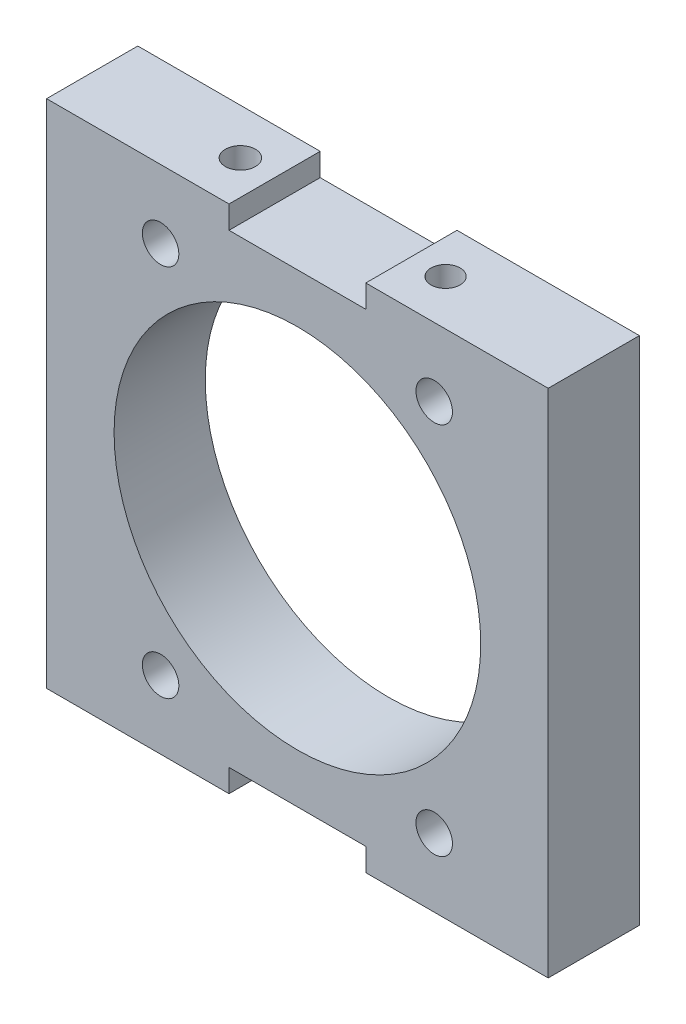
ISO-10303-21;
HEADER;
FILE_DESCRIPTION(('STEP AP214'),'2;1');
FILE_NAME('part.step','',(''),(''),'','','');
FILE_SCHEMA(('AUTOMOTIVE_DESIGN { 1 0 10303 214 1 1 1 1 }'));
ENDSEC;
DATA;
#1=APPLICATION_CONTEXT('core data for automotive mechanical design processes');
#2=APPLICATION_PROTOCOL_DEFINITION('international standard','automotive_design',2000,#1);
#3=PRODUCT_CONTEXT('',#1,'mechanical');
#4=PRODUCT('Part','Part','',(#3));
#5=PRODUCT_RELATED_PRODUCT_CATEGORY('part','',(#4));
#6=PRODUCT_DEFINITION_FORMATION('','',#4);
#7=PRODUCT_DEFINITION_CONTEXT('part definition',#1,'design');
#8=PRODUCT_DEFINITION('design','',#6,#7);
#9=PRODUCT_DEFINITION_SHAPE('','',#8);
#10=(LENGTH_UNIT() NAMED_UNIT(*) SI_UNIT(.MILLI.,.METRE.));
#11=(NAMED_UNIT(*) PLANE_ANGLE_UNIT() SI_UNIT($,.RADIAN.));
#12=(NAMED_UNIT(*) SI_UNIT($,.STERADIAN.) SOLID_ANGLE_UNIT());
#13=UNCERTAINTY_MEASURE_WITH_UNIT(LENGTH_MEASURE(1.E-05),#10,'distance_accuracy_value','');
#14=(GEOMETRIC_REPRESENTATION_CONTEXT(3) GLOBAL_UNCERTAINTY_ASSIGNED_CONTEXT((#13)) GLOBAL_UNIT_ASSIGNED_CONTEXT((#10,
#11,#12)) REPRESENTATION_CONTEXT('',''));
#15=CARTESIAN_POINT('',(0.,0.,0.));
#16=DIRECTION('',(0.,0.,1.));
#17=DIRECTION('',(1.,0.,0.));
#18=AXIS2_PLACEMENT_3D('',#15,#16,#17);
#19=CARTESIAN_POINT('',(0.,0.,20.));
#20=DIRECTION('',(0.,0.,-1.));
#21=DIRECTION('',(-1.,0.,0.));
#22=AXIS2_PLACEMENT_3D('',#19,#20,#21);
#23=PLANE('',#22);
#24=CARTESIAN_POINT('',(30.,40.9999999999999,20.));
#25=DIRECTION('',(0.,0.,1.));
#26=DIRECTION('',(1.,0.,0.));
#27=AXIS2_PLACEMENT_3D('',#24,#25,#26);
#28=CIRCLE('',#27,4.);
#29=CARTESIAN_POINT('',(34.,40.9999999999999,20.));
#30=VERTEX_POINT('',#29);
#31=EDGE_CURVE('E278',#30,#30,#28,.T.);
#32=ORIENTED_EDGE('',*,*,#31,.F.);
#33=EDGE_LOOP('',(#32));
#34=FACE_BOUND('',#33,.T.);
#35=CARTESIAN_POINT('',(-30.,40.9999999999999,20.));
#36=DIRECTION('',(0.,0.,1.));
#37=DIRECTION('',(1.,0.,0.));
#38=AXIS2_PLACEMENT_3D('',#35,#36,#37);
#39=CIRCLE('',#38,4.00000000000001);
#40=CARTESIAN_POINT('',(-26.,40.9999999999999,20.));
#41=VERTEX_POINT('',#40);
#42=EDGE_CURVE('E266',#41,#41,#39,.T.);
#43=ORIENTED_EDGE('',*,*,#42,.F.);
#44=EDGE_LOOP('',(#43));
#45=FACE_BOUND('',#44,.T.);
#46=DIRECTION('',(-1.,0.,0.));
#47=VECTOR('',#46,1.);
#48=CARTESIAN_POINT('',(-55.,55.9999999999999,20.));
#49=LINE('',#48,#47);
#50=CARTESIAN_POINT('',(-15.0000000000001,55.9999999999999,20.));
#51=VERTEX_POINT('',#50);
#52=CARTESIAN_POINT('',(-55.,55.9999999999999,20.));
#53=VERTEX_POINT('',#52);
#54=EDGE_CURVE('E193',#51,#53,#49,.T.);
#55=ORIENTED_EDGE('',*,*,#54,.T.);
#56=DIRECTION('',(0.,-1.,0.));
#57=VECTOR('',#56,1.);
#58=CARTESIAN_POINT('',(-55.,55.9999999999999,20.));
#59=LINE('',#58,#57);
#60=CARTESIAN_POINT('',(-55.,-55.9999999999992,20.));
#61=VERTEX_POINT('',#60);
#62=EDGE_CURVE('E114',#53,#61,#59,.T.);
#63=ORIENTED_EDGE('',*,*,#62,.T.);
#64=DIRECTION('',(1.,0.,0.));
#65=VECTOR('',#64,1.);
#66=CARTESIAN_POINT('',(-15.,-55.9999999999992,20.));
#67=LINE('',#66,#65);
#68=CARTESIAN_POINT('',(-15.,-55.9999999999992,20.));
#69=VERTEX_POINT('',#68);
#70=EDGE_CURVE('E239',#61,#69,#67,.T.);
#71=ORIENTED_EDGE('',*,*,#70,.T.);
#72=DIRECTION('',(0.,1.,0.));
#73=VECTOR('',#72,1.);
#74=CARTESIAN_POINT('',(-15.,-55.9999999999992,20.));
#75=LINE('',#74,#73);
#76=CARTESIAN_POINT('',(-15.,-50.9999999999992,20.));
#77=VERTEX_POINT('',#76);
#78=EDGE_CURVE('E236',#69,#77,#75,.T.);
#79=ORIENTED_EDGE('',*,*,#78,.T.);
#80=DIRECTION('',(1.,0.,0.));
#81=VECTOR('',#80,1.);
#82=CARTESIAN_POINT('',(15.0000000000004,-50.9999999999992,20.));
#83=LINE('',#82,#81);
#84=CARTESIAN_POINT('',(15.0000000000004,-50.9999999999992,20.));
#85=VERTEX_POINT('',#84);
#86=EDGE_CURVE('E238',#77,#85,#83,.T.);
#87=ORIENTED_EDGE('',*,*,#86,.T.);
#88=DIRECTION('',(0.,-1.,0.));
#89=VECTOR('',#88,1.);
#90=CARTESIAN_POINT('',(15.0000000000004,-56.0000000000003,20.));
#91=LINE('',#90,#89);
#92=CARTESIAN_POINT('',(15.0000000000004,-56.0000000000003,20.));
#93=VERTEX_POINT('',#92);
#94=EDGE_CURVE('E241',#85,#93,#91,.T.);
#95=ORIENTED_EDGE('',*,*,#94,.T.);
#96=DIRECTION('',(1.,0.,0.));
#97=VECTOR('',#96,1.);
#98=CARTESIAN_POINT('',(15.0000000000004,-56.0000000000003,20.));
#99=LINE('',#98,#97);
#100=CARTESIAN_POINT('',(55.,-56.0000000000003,20.));
#101=VERTEX_POINT('',#100);
#102=EDGE_CURVE('E247',#93,#101,#99,.T.);
#103=ORIENTED_EDGE('',*,*,#102,.T.);
#104=DIRECTION('',(0.,1.,0.));
#105=VECTOR('',#104,1.);
#106=CARTESIAN_POINT('',(55.,56.0000000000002,20.));
#107=LINE('',#106,#105);
#108=CARTESIAN_POINT('',(55.,56.0000000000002,20.));
#109=VERTEX_POINT('',#108);
#110=EDGE_CURVE('E249',#101,#109,#107,.T.);
#111=ORIENTED_EDGE('',*,*,#110,.T.);
#112=DIRECTION('',(-1.,0.,0.));
#113=VECTOR('',#112,1.);
#114=CARTESIAN_POINT('',(15.0000000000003,56.0000000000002,20.));
#115=LINE('',#114,#113);
#116=CARTESIAN_POINT('',(15.0000000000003,56.0000000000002,20.));
#117=VERTEX_POINT('',#116);
#118=EDGE_CURVE('E148',#109,#117,#115,.T.);
#119=ORIENTED_EDGE('',*,*,#118,.T.);
#120=DIRECTION('',(0.,-1.,0.));
#121=VECTOR('',#120,1.);
#122=CARTESIAN_POINT('',(15.0000000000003,50.9999999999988,20.));
#123=LINE('',#122,#121);
#124=CARTESIAN_POINT('',(15.0000000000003,50.9999999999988,20.));
#125=VERTEX_POINT('',#124);
#126=EDGE_CURVE('E141',#117,#125,#123,.T.);
#127=ORIENTED_EDGE('',*,*,#126,.T.);
#128=DIRECTION('',(-1.,0.,0.));
#129=VECTOR('',#128,1.);
#130=CARTESIAN_POINT('',(-15.,50.9999999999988,20.));
#131=LINE('',#130,#129);
#132=CARTESIAN_POINT('',(-15.,50.9999999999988,20.));
#133=VERTEX_POINT('',#132);
#134=EDGE_CURVE('E145',#125,#133,#131,.T.);
#135=ORIENTED_EDGE('',*,*,#134,.T.);
#136=DIRECTION('',(0.,1.,0.));
#137=VECTOR('',#136,1.);
#138=CARTESIAN_POINT('',(-15.0000000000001,55.9999999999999,20.));
#139=LINE('',#138,#137);
#140=EDGE_CURVE('E60',#133,#51,#139,.T.);
#141=ORIENTED_EDGE('',*,*,#140,.T.);
#142=EDGE_LOOP('',(#55,#63,#71,#79,#87,#95,#103,#111,#119,#127,#135,#141));
#143=FACE_BOUND('',#142,.T.);
#144=CARTESIAN_POINT('',(0.,0.,20.));
#145=DIRECTION('',(0.,0.,1.));
#146=DIRECTION('',(1.,0.,0.));
#147=AXIS2_PLACEMENT_3D('',#144,#145,#146);
#148=CIRCLE('',#147,40.2);
#149=CARTESIAN_POINT('',(40.2,0.,20.));
#150=VERTEX_POINT('',#149);
#151=EDGE_CURVE('E173',#150,#150,#148,.T.);
#152=ORIENTED_EDGE('',*,*,#151,.F.);
#153=EDGE_LOOP('',(#152));
#154=FACE_BOUND('',#153,.T.);
#155=CARTESIAN_POINT('',(-30.,-40.9999999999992,20.));
#156=DIRECTION('',(0.,0.,1.));
#157=DIRECTION('',(1.,0.,0.));
#158=AXIS2_PLACEMENT_3D('',#155,#156,#157);
#159=CIRCLE('',#158,4.00000000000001);
#160=CARTESIAN_POINT('',(-26.,-40.9999999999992,20.));
#161=VERTEX_POINT('',#160);
#162=EDGE_CURVE('E272',#161,#161,#159,.T.);
#163=ORIENTED_EDGE('',*,*,#162,.F.);
#164=EDGE_LOOP('',(#163));
#165=FACE_BOUND('',#164,.T.);
#166=CARTESIAN_POINT('',(30.,-40.9999999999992,20.));
#167=DIRECTION('',(0.,0.,1.));
#168=DIRECTION('',(1.,0.,0.));
#169=AXIS2_PLACEMENT_3D('',#166,#167,#168);
#170=CIRCLE('',#169,4.);
#171=CARTESIAN_POINT('',(34.,-40.9999999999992,20.));
#172=VERTEX_POINT('',#171);
#173=EDGE_CURVE('E284',#172,#172,#170,.T.);
#174=ORIENTED_EDGE('',*,*,#173,.F.);
#175=EDGE_LOOP('',(#174));
#176=FACE_BOUND('',#175,.T.);
#177=ADVANCED_FACE('F32',(#34,#45,#143,#154,#165,#176),#23,.F.);
#178=CARTESIAN_POINT('',(0.,0.,0.));
#179=DIRECTION('',(0.,0.,-1.));
#180=DIRECTION('',(-1.,0.,0.));
#181=AXIS2_PLACEMENT_3D('',#178,#179,#180);
#182=PLANE('',#181);
#183=CARTESIAN_POINT('',(30.,40.9999999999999,0.));
#184=DIRECTION('',(0.,0.,1.));
#185=DIRECTION('',(1.,0.,0.));
#186=AXIS2_PLACEMENT_3D('',#183,#184,#185);
#187=CIRCLE('',#186,4.);
#188=CARTESIAN_POINT('',(34.,40.9999999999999,0.));
#189=VERTEX_POINT('',#188);
#190=EDGE_CURVE('E281',#189,#189,#187,.T.);
#191=ORIENTED_EDGE('',*,*,#190,.T.);
#192=EDGE_LOOP('',(#191));
#193=FACE_BOUND('',#192,.T.);
#194=CARTESIAN_POINT('',(-30.,40.9999999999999,0.));
#195=DIRECTION('',(0.,0.,1.));
#196=DIRECTION('',(1.,0.,0.));
#197=AXIS2_PLACEMENT_3D('',#194,#195,#196);
#198=CIRCLE('',#197,4.00000000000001);
#199=CARTESIAN_POINT('',(-26.,40.9999999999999,0.));
#200=VERTEX_POINT('',#199);
#201=EDGE_CURVE('E269',#200,#200,#198,.T.);
#202=ORIENTED_EDGE('',*,*,#201,.T.);
#203=EDGE_LOOP('',(#202));
#204=FACE_BOUND('',#203,.T.);
#205=DIRECTION('',(-1.,0.,0.));
#206=VECTOR('',#205,1.);
#207=CARTESIAN_POINT('',(-55.,55.9999999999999,0.));
#208=LINE('',#207,#206);
#209=CARTESIAN_POINT('',(-15.0000000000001,55.9999999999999,0.));
#210=VERTEX_POINT('',#209);
#211=CARTESIAN_POINT('',(-55.,55.9999999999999,0.));
#212=VERTEX_POINT('',#211);
#213=EDGE_CURVE('E169',#210,#212,#208,.T.);
#214=ORIENTED_EDGE('',*,*,#213,.F.);
#215=DIRECTION('',(0.,1.,0.));
#216=VECTOR('',#215,1.);
#217=CARTESIAN_POINT('',(-15.0000000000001,55.9999999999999,0.));
#218=LINE('',#217,#216);
#219=CARTESIAN_POINT('',(-15.,50.9999999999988,0.));
#220=VERTEX_POINT('',#219);
#221=EDGE_CURVE('E105',#220,#210,#218,.T.);
#222=ORIENTED_EDGE('',*,*,#221,.F.);
#223=DIRECTION('',(-1.,0.,0.));
#224=VECTOR('',#223,1.);
#225=CARTESIAN_POINT('',(-15.,50.9999999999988,0.));
#226=LINE('',#225,#224);
#227=CARTESIAN_POINT('',(15.0000000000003,50.9999999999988,0.));
#228=VERTEX_POINT('',#227);
#229=EDGE_CURVE('E190',#228,#220,#226,.T.);
#230=ORIENTED_EDGE('',*,*,#229,.F.);
#231=DIRECTION('',(0.,-1.,0.));
#232=VECTOR('',#231,1.);
#233=CARTESIAN_POINT('',(15.0000000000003,50.9999999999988,0.));
#234=LINE('',#233,#232);
#235=CARTESIAN_POINT('',(15.0000000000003,56.0000000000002,0.));
#236=VERTEX_POINT('',#235);
#237=EDGE_CURVE('E157',#236,#228,#234,.T.);
#238=ORIENTED_EDGE('',*,*,#237,.F.);
#239=DIRECTION('',(-1.,0.,0.));
#240=VECTOR('',#239,1.);
#241=CARTESIAN_POINT('',(15.0000000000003,56.0000000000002,0.));
#242=LINE('',#241,#240);
#243=CARTESIAN_POINT('',(55.,56.0000000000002,0.));
#244=VERTEX_POINT('',#243);
#245=EDGE_CURVE('E187',#244,#236,#242,.T.);
#246=ORIENTED_EDGE('',*,*,#245,.F.);
#247=DIRECTION('',(0.,1.,0.));
#248=VECTOR('',#247,1.);
#249=CARTESIAN_POINT('',(55.,56.0000000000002,0.));
#250=LINE('',#249,#248);
#251=CARTESIAN_POINT('',(55.,-56.0000000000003,0.));
#252=VERTEX_POINT('',#251);
#253=EDGE_CURVE('E185',#252,#244,#250,.T.);
#254=ORIENTED_EDGE('',*,*,#253,.F.);
#255=DIRECTION('',(1.,0.,0.));
#256=VECTOR('',#255,1.);
#257=CARTESIAN_POINT('',(15.0000000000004,-56.0000000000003,0.));
#258=LINE('',#257,#256);
#259=CARTESIAN_POINT('',(15.0000000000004,-56.0000000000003,0.));
#260=VERTEX_POINT('',#259);
#261=EDGE_CURVE('E183',#260,#252,#258,.T.);
#262=ORIENTED_EDGE('',*,*,#261,.F.);
#263=DIRECTION('',(0.,-1.,0.));
#264=VECTOR('',#263,1.);
#265=CARTESIAN_POINT('',(15.0000000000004,-56.0000000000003,0.));
#266=LINE('',#265,#264);
#267=CARTESIAN_POINT('',(15.0000000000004,-50.9999999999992,0.));
#268=VERTEX_POINT('',#267);
#269=EDGE_CURVE('E181',#268,#260,#266,.T.);
#270=ORIENTED_EDGE('',*,*,#269,.F.);
#271=DIRECTION('',(1.,0.,0.));
#272=VECTOR('',#271,1.);
#273=CARTESIAN_POINT('',(15.0000000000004,-50.9999999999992,0.));
#274=LINE('',#273,#272);
#275=CARTESIAN_POINT('',(-15.,-50.9999999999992,0.));
#276=VERTEX_POINT('',#275);
#277=EDGE_CURVE('E179',#276,#268,#274,.T.);
#278=ORIENTED_EDGE('',*,*,#277,.F.);
#279=DIRECTION('',(0.,1.,0.));
#280=VECTOR('',#279,1.);
#281=CARTESIAN_POINT('',(-15.,-55.9999999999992,0.));
#282=LINE('',#281,#280);
#283=CARTESIAN_POINT('',(-15.,-55.9999999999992,0.));
#284=VERTEX_POINT('',#283);
#285=EDGE_CURVE('E177',#284,#276,#282,.T.);
#286=ORIENTED_EDGE('',*,*,#285,.F.);
#287=DIRECTION('',(1.,0.,0.));
#288=VECTOR('',#287,1.);
#289=CARTESIAN_POINT('',(-15.,-55.9999999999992,0.));
#290=LINE('',#289,#288);
#291=CARTESIAN_POINT('',(-55.,-55.9999999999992,0.));
#292=VERTEX_POINT('',#291);
#293=EDGE_CURVE('E175',#292,#284,#290,.T.);
#294=ORIENTED_EDGE('',*,*,#293,.F.);
#295=DIRECTION('',(0.,-1.,0.));
#296=VECTOR('',#295,1.);
#297=CARTESIAN_POINT('',(-55.,55.9999999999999,0.));
#298=LINE('',#297,#296);
#299=EDGE_CURVE('E172',#212,#292,#298,.T.);
#300=ORIENTED_EDGE('',*,*,#299,.F.);
#301=EDGE_LOOP('',(#214,#222,#230,#238,#246,#254,#262,#270,#278,#286,#294,#300));
#302=FACE_BOUND('',#301,.T.);
#303=CARTESIAN_POINT('',(0.,0.,0.));
#304=DIRECTION('',(0.,0.,1.));
#305=DIRECTION('',(1.,0.,0.));
#306=AXIS2_PLACEMENT_3D('',#303,#304,#305);
#307=CIRCLE('',#306,40.2);
#308=CARTESIAN_POINT('',(40.2,0.,0.));
#309=VERTEX_POINT('',#308);
#310=EDGE_CURVE('E263',#309,#309,#307,.T.);
#311=ORIENTED_EDGE('',*,*,#310,.T.);
#312=EDGE_LOOP('',(#311));
#313=FACE_BOUND('',#312,.T.);
#314=CARTESIAN_POINT('',(-30.,-40.9999999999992,0.));
#315=DIRECTION('',(0.,0.,1.));
#316=DIRECTION('',(1.,0.,0.));
#317=AXIS2_PLACEMENT_3D('',#314,#315,#316);
#318=CIRCLE('',#317,4.00000000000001);
#319=CARTESIAN_POINT('',(-26.,-40.9999999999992,0.));
#320=VERTEX_POINT('',#319);
#321=EDGE_CURVE('E275',#320,#320,#318,.T.);
#322=ORIENTED_EDGE('',*,*,#321,.T.);
#323=EDGE_LOOP('',(#322));
#324=FACE_BOUND('',#323,.T.);
#325=CARTESIAN_POINT('',(30.,-40.9999999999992,0.));
#326=DIRECTION('',(0.,0.,1.));
#327=DIRECTION('',(1.,0.,0.));
#328=AXIS2_PLACEMENT_3D('',#325,#326,#327);
#329=CIRCLE('',#328,4.);
#330=CARTESIAN_POINT('',(34.,-40.9999999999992,0.));
#331=VERTEX_POINT('',#330);
#332=EDGE_CURVE('E287',#331,#331,#329,.T.);
#333=ORIENTED_EDGE('',*,*,#332,.T.);
#334=EDGE_LOOP('',(#333));
#335=FACE_BOUND('',#334,.T.);
#336=ADVANCED_FACE('F223',(#193,#204,#302,#313,#324,#335),#182,.T.);
#337=CARTESIAN_POINT('',(-55.,55.9999999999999,20.));
#338=DIRECTION('',(0.,-1.,0.));
#339=DIRECTION('',(1.,0.,0.));
#340=AXIS2_PLACEMENT_3D('',#337,#338,#339);
#341=PLANE('',#340);
#342=CARTESIAN_POINT('',(-22.5000000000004,55.9999999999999,10.));
#343=DIRECTION('',(0.,1.,0.));
#344=DIRECTION('',(0.,0.,1.));
#345=AXIS2_PLACEMENT_3D('',#342,#343,#344);
#346=CIRCLE('',#345,3.29999999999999);
#347=CARTESIAN_POINT('',(-22.5000000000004,55.9999999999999,13.3));
#348=VERTEX_POINT('',#347);
#349=EDGE_CURVE('E323',#348,#348,#346,.T.);
#350=ORIENTED_EDGE('',*,*,#349,.F.);
#351=EDGE_LOOP('',(#350));
#352=FACE_BOUND('',#351,.T.);
#353=ORIENTED_EDGE('',*,*,#213,.T.);
#354=DIRECTION('',(0.,0.,-1.));
#355=VECTOR('',#354,1.);
#356=CARTESIAN_POINT('',(-55.,55.9999999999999,20.));
#357=LINE('',#356,#355);
#358=EDGE_CURVE('E45',#53,#212,#357,.T.);
#359=ORIENTED_EDGE('',*,*,#358,.F.);
#360=ORIENTED_EDGE('',*,*,#54,.F.);
#361=DIRECTION('',(0.,0.,-1.));
#362=VECTOR('',#361,1.);
#363=CARTESIAN_POINT('',(-15.0000000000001,55.9999999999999,20.));
#364=LINE('',#363,#362);
#365=EDGE_CURVE('E165',#51,#210,#364,.T.);
#366=ORIENTED_EDGE('',*,*,#365,.T.);
#367=EDGE_LOOP('',(#353,#359,#360,#366));
#368=FACE_BOUND('',#367,.T.);
#369=ADVANCED_FACE('F34',(#352,#368),#341,.F.);
#370=CARTESIAN_POINT('',(-55.,55.9999999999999,20.));
#371=DIRECTION('',(1.,0.,0.));
#372=DIRECTION('',(0.,1.,0.));
#373=AXIS2_PLACEMENT_3D('',#370,#371,#372);
#374=PLANE('',#373);
#375=ORIENTED_EDGE('',*,*,#299,.T.);
#376=DIRECTION('',(0.,0.,-1.));
#377=VECTOR('',#376,1.);
#378=CARTESIAN_POINT('',(-55.,-55.9999999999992,20.));
#379=LINE('',#378,#377);
#380=EDGE_CURVE('E215',#61,#292,#379,.T.);
#381=ORIENTED_EDGE('',*,*,#380,.F.);
#382=ORIENTED_EDGE('',*,*,#62,.F.);
#383=ORIENTED_EDGE('',*,*,#358,.T.);
#384=EDGE_LOOP('',(#375,#381,#382,#383));
#385=FACE_BOUND('',#384,.T.);
#386=ADVANCED_FACE('F218',(#385),#374,.F.);
#387=CARTESIAN_POINT('',(-15.,-55.9999999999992,20.));
#388=DIRECTION('',(0.,1.,0.));
#389=DIRECTION('',(0.,0.,1.));
#390=AXIS2_PLACEMENT_3D('',#387,#388,#389);
#391=PLANE('',#390);
#392=CARTESIAN_POINT('',(-22.5000000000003,-55.9999999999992,10.));
#393=DIRECTION('',(0.,-1.,0.));
#394=DIRECTION('',(0.,0.,-1.));
#395=AXIS2_PLACEMENT_3D('',#392,#393,#394);
#396=CIRCLE('',#395,3.19999999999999);
#397=CARTESIAN_POINT('',(-22.5000000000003,-55.9999999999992,6.80000000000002));
#398=VERTEX_POINT('',#397);
#399=EDGE_CURVE('E311',#398,#398,#396,.T.);
#400=ORIENTED_EDGE('',*,*,#399,.F.);
#401=EDGE_LOOP('',(#400));
#402=FACE_BOUND('',#401,.T.);
#403=ORIENTED_EDGE('',*,*,#293,.T.);
#404=DIRECTION('',(0.,0.,-1.));
#405=VECTOR('',#404,1.);
#406=CARTESIAN_POINT('',(-15.,-55.9999999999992,20.));
#407=LINE('',#406,#405);
#408=EDGE_CURVE('E212',#69,#284,#407,.T.);
#409=ORIENTED_EDGE('',*,*,#408,.F.);
#410=ORIENTED_EDGE('',*,*,#70,.F.);
#411=ORIENTED_EDGE('',*,*,#380,.T.);
#412=EDGE_LOOP('',(#403,#409,#410,#411));
#413=FACE_BOUND('',#412,.T.);
#414=ADVANCED_FACE('F230',(#402,#413),#391,.F.);
#415=CARTESIAN_POINT('',(-15.,-55.9999999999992,20.));
#416=DIRECTION('',(-1.,0.,0.));
#417=DIRECTION('',(0.,0.,1.));
#418=AXIS2_PLACEMENT_3D('',#415,#416,#417);
#419=PLANE('',#418);
#420=ORIENTED_EDGE('',*,*,#285,.T.);
#421=DIRECTION('',(0.,0.,-1.));
#422=VECTOR('',#421,1.);
#423=CARTESIAN_POINT('',(-15.,-50.9999999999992,20.));
#424=LINE('',#423,#422);
#425=EDGE_CURVE('E209',#77,#276,#424,.T.);
#426=ORIENTED_EDGE('',*,*,#425,.F.);
#427=ORIENTED_EDGE('',*,*,#78,.F.);
#428=ORIENTED_EDGE('',*,*,#408,.T.);
#429=EDGE_LOOP('',(#420,#426,#427,#428));
#430=FACE_BOUND('',#429,.T.);
#431=ADVANCED_FACE('F234',(#430),#419,.F.);
#432=CARTESIAN_POINT('',(15.0000000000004,-50.9999999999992,20.));
#433=DIRECTION('',(0.,1.,0.));
#434=DIRECTION('',(0.,0.,1.));
#435=AXIS2_PLACEMENT_3D('',#432,#433,#434);
#436=PLANE('',#435);
#437=ORIENTED_EDGE('',*,*,#277,.T.);
#438=DIRECTION('',(0.,0.,-1.));
#439=VECTOR('',#438,1.);
#440=CARTESIAN_POINT('',(15.0000000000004,-50.9999999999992,20.));
#441=LINE('',#440,#439);
#442=EDGE_CURVE('E206',#85,#268,#441,.T.);
#443=ORIENTED_EDGE('',*,*,#442,.F.);
#444=ORIENTED_EDGE('',*,*,#86,.F.);
#445=ORIENTED_EDGE('',*,*,#425,.T.);
#446=EDGE_LOOP('',(#437,#443,#444,#445));
#447=FACE_BOUND('',#446,.T.);
#448=ADVANCED_FACE('F365',(#447),#436,.F.);
#449=CARTESIAN_POINT('',(15.0000000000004,-56.0000000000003,20.));
#450=DIRECTION('',(1.,0.,0.));
#451=DIRECTION('',(0.,0.,-1.));
#452=AXIS2_PLACEMENT_3D('',#449,#450,#451);
#453=PLANE('',#452);
#454=ORIENTED_EDGE('',*,*,#269,.T.);
#455=DIRECTION('',(0.,0.,-1.));
#456=VECTOR('',#455,1.);
#457=CARTESIAN_POINT('',(15.0000000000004,-56.0000000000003,20.));
#458=LINE('',#457,#456);
#459=EDGE_CURVE('E203',#93,#260,#458,.T.);
#460=ORIENTED_EDGE('',*,*,#459,.F.);
#461=ORIENTED_EDGE('',*,*,#94,.F.);
#462=ORIENTED_EDGE('',*,*,#442,.T.);
#463=EDGE_LOOP('',(#454,#460,#461,#462));
#464=FACE_BOUND('',#463,.T.);
#465=ADVANCED_FACE('F361',(#464),#453,.F.);
#466=CARTESIAN_POINT('',(15.0000000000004,-56.0000000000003,20.));
#467=DIRECTION('',(0.,1.,0.));
#468=DIRECTION('',(0.,0.,1.));
#469=AXIS2_PLACEMENT_3D('',#466,#467,#468);
#470=PLANE('',#469);
#471=CARTESIAN_POINT('',(22.4999999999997,-55.9999999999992,10.0000000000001));
#472=DIRECTION('',(0.,-1.,0.));
#473=DIRECTION('',(0.,0.,-1.));
#474=AXIS2_PLACEMENT_3D('',#471,#472,#473);
#475=CIRCLE('',#474,3.19999999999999);
#476=CARTESIAN_POINT('',(22.4999999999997,-55.9999999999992,6.80000000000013));
#477=VERTEX_POINT('',#476);
#478=EDGE_CURVE('E317',#477,#477,#475,.T.);
#479=ORIENTED_EDGE('',*,*,#478,.F.);
#480=EDGE_LOOP('',(#479));
#481=FACE_BOUND('',#480,.T.);
#482=ORIENTED_EDGE('',*,*,#261,.T.);
#483=DIRECTION('',(0.,0.,-1.));
#484=VECTOR('',#483,1.);
#485=CARTESIAN_POINT('',(55.,-56.0000000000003,20.));
#486=LINE('',#485,#484);
#487=EDGE_CURVE('E200',#101,#252,#486,.T.);
#488=ORIENTED_EDGE('',*,*,#487,.F.);
#489=ORIENTED_EDGE('',*,*,#102,.F.);
#490=ORIENTED_EDGE('',*,*,#459,.T.);
#491=EDGE_LOOP('',(#482,#488,#489,#490));
#492=FACE_BOUND('',#491,.T.);
#493=ADVANCED_FACE('F358',(#481,#492),#470,.F.);
#494=CARTESIAN_POINT('',(55.,56.0000000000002,20.));
#495=DIRECTION('',(-1.,0.,0.));
#496=DIRECTION('',(0.,0.,1.));
#497=AXIS2_PLACEMENT_3D('',#494,#495,#496);
#498=PLANE('',#497);
#499=ORIENTED_EDGE('',*,*,#253,.T.);
#500=DIRECTION('',(0.,0.,-1.));
#501=VECTOR('',#500,1.);
#502=CARTESIAN_POINT('',(55.,56.0000000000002,20.));
#503=LINE('',#502,#501);
#504=EDGE_CURVE('E197',#109,#244,#503,.T.);
#505=ORIENTED_EDGE('',*,*,#504,.F.);
#506=ORIENTED_EDGE('',*,*,#110,.F.);
#507=ORIENTED_EDGE('',*,*,#487,.T.);
#508=EDGE_LOOP('',(#499,#505,#506,#507));
#509=FACE_BOUND('',#508,.T.);
#510=ADVANCED_FACE('F255',(#509),#498,.F.);
#511=CARTESIAN_POINT('',(15.0000000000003,56.0000000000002,20.));
#512=DIRECTION('',(0.,-1.,0.));
#513=DIRECTION('',(1.,0.,0.));
#514=AXIS2_PLACEMENT_3D('',#511,#512,#513);
#515=PLANE('',#514);
#516=CARTESIAN_POINT('',(22.4999999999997,56.0000000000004,10.0000000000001));
#517=DIRECTION('',(0.,1.,0.));
#518=DIRECTION('',(0.,0.,1.));
#519=AXIS2_PLACEMENT_3D('',#516,#517,#518);
#520=CIRCLE('',#519,3.19999999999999);
#521=CARTESIAN_POINT('',(25.2029138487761,56.0000000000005,8.28703277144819));
#522=VERTEX_POINT('',#521);
#523=CARTESIAN_POINT('',(19.8191997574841,56.0000000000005,11.7473723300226));
#524=VERTEX_POINT('',#523);
#525=EDGE_CURVE('E295',#522,#524,#520,.T.);
#526=ORIENTED_EDGE('',*,*,#525,.F.);
#527=CARTESIAN_POINT('',(22.5221136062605,56.0000000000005,10.0344051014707));
#528=DIRECTION('',(0.,1.,0.));
#529=DIRECTION('',(0.,0.,1.));
#530=AXIS2_PLACEMENT_3D('',#527,#528,#529);
#531=CIRCLE('',#530,3.19999999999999);
#532=EDGE_CURVE('E305',#524,#522,#531,.T.);
#533=ORIENTED_EDGE('',*,*,#532,.F.);
#534=EDGE_LOOP('',(#526,#533));
#535=FACE_BOUND('',#534,.T.);
#536=ORIENTED_EDGE('',*,*,#245,.T.);
#537=DIRECTION('',(0.,0.,-1.));
#538=VECTOR('',#537,1.);
#539=CARTESIAN_POINT('',(15.0000000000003,56.0000000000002,20.));
#540=LINE('',#539,#538);
#541=EDGE_CURVE('E160',#117,#236,#540,.T.);
#542=ORIENTED_EDGE('',*,*,#541,.F.);
#543=ORIENTED_EDGE('',*,*,#118,.F.);
#544=ORIENTED_EDGE('',*,*,#504,.T.);
#545=EDGE_LOOP('',(#536,#542,#543,#544));
#546=FACE_BOUND('',#545,.T.);
#547=ADVANCED_FACE('F259',(#535,#546),#515,.F.);
#548=CARTESIAN_POINT('',(15.0000000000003,50.9999999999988,20.));
#549=DIRECTION('',(1.,0.,0.));
#550=DIRECTION('',(0.,1.,0.));
#551=AXIS2_PLACEMENT_3D('',#548,#549,#550);
#552=PLANE('',#551);
#553=ORIENTED_EDGE('',*,*,#237,.T.);
#554=DIRECTION('',(0.,0.,-1.));
#555=VECTOR('',#554,1.);
#556=CARTESIAN_POINT('',(15.0000000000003,50.9999999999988,20.));
#557=LINE('',#556,#555);
#558=EDGE_CURVE('E154',#125,#228,#557,.T.);
#559=ORIENTED_EDGE('',*,*,#558,.F.);
#560=ORIENTED_EDGE('',*,*,#126,.F.);
#561=ORIENTED_EDGE('',*,*,#541,.T.);
#562=EDGE_LOOP('',(#553,#559,#560,#561));
#563=FACE_BOUND('',#562,.T.);
#564=ADVANCED_FACE('F155',(#563),#552,.F.);
#565=CARTESIAN_POINT('',(-15.,50.9999999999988,20.));
#566=DIRECTION('',(0.,-1.,0.));
#567=DIRECTION('',(0.,0.,-1.));
#568=AXIS2_PLACEMENT_3D('',#565,#566,#567);
#569=PLANE('',#568);
#570=ORIENTED_EDGE('',*,*,#229,.T.);
#571=DIRECTION('',(0.,0.,-1.));
#572=VECTOR('',#571,1.);
#573=CARTESIAN_POINT('',(-15.,50.9999999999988,20.));
#574=LINE('',#573,#572);
#575=EDGE_CURVE('E161',#133,#220,#574,.T.);
#576=ORIENTED_EDGE('',*,*,#575,.F.);
#577=ORIENTED_EDGE('',*,*,#134,.F.);
#578=ORIENTED_EDGE('',*,*,#558,.T.);
#579=EDGE_LOOP('',(#570,#576,#577,#578));
#580=FACE_BOUND('',#579,.T.);
#581=ADVANCED_FACE('F163',(#580),#569,.F.);
#582=CARTESIAN_POINT('',(-15.0000000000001,55.9999999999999,20.));
#583=DIRECTION('',(-1.,0.,0.));
#584=DIRECTION('',(0.,-1.,0.));
#585=AXIS2_PLACEMENT_3D('',#582,#583,#584);
#586=PLANE('',#585);
#587=ORIENTED_EDGE('',*,*,#221,.T.);
#588=ORIENTED_EDGE('',*,*,#365,.F.);
#589=ORIENTED_EDGE('',*,*,#140,.F.);
#590=ORIENTED_EDGE('',*,*,#575,.T.);
#591=EDGE_LOOP('',(#587,#588,#589,#590));
#592=FACE_BOUND('',#591,.T.);
#593=ADVANCED_FACE('F260',(#592),#586,.F.);
#594=CARTESIAN_POINT('',(0.,0.,20.));
#595=DIRECTION('',(0.,0.,-1.));
#596=DIRECTION('',(-1.,0.,0.));
#597=AXIS2_PLACEMENT_3D('',#594,#595,#596);
#598=CYLINDRICAL_SURFACE('',#597,40.2);
#599=ORIENTED_EDGE('',*,*,#151,.T.);
#600=EDGE_LOOP('',(#599));
#601=FACE_BOUND('',#600,.T.);
#602=ORIENTED_EDGE('',*,*,#310,.F.);
#603=EDGE_LOOP('',(#602));
#604=FACE_BOUND('',#603,.T.);
#605=ADVANCED_FACE('F344',(#601,#604),#598,.F.);
#606=CARTESIAN_POINT('',(-30.,40.9999999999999,20.));
#607=DIRECTION('',(0.,0.,-1.));
#608=DIRECTION('',(-1.,0.,0.));
#609=AXIS2_PLACEMENT_3D('',#606,#607,#608);
#610=CYLINDRICAL_SURFACE('',#609,4.00000000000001);
#611=ORIENTED_EDGE('',*,*,#42,.T.);
#612=EDGE_LOOP('',(#611));
#613=FACE_BOUND('',#612,.T.);
#614=ORIENTED_EDGE('',*,*,#201,.F.);
#615=EDGE_LOOP('',(#614));
#616=FACE_BOUND('',#615,.T.);
#617=ADVANCED_FACE('F422',(#613,#616),#610,.F.);
#618=CARTESIAN_POINT('',(-30.,-40.9999999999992,20.));
#619=DIRECTION('',(0.,0.,-1.));
#620=DIRECTION('',(-1.,0.,0.));
#621=AXIS2_PLACEMENT_3D('',#618,#619,#620);
#622=CYLINDRICAL_SURFACE('',#621,4.00000000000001);
#623=ORIENTED_EDGE('',*,*,#162,.T.);
#624=EDGE_LOOP('',(#623));
#625=FACE_BOUND('',#624,.T.);
#626=ORIENTED_EDGE('',*,*,#321,.F.);
#627=EDGE_LOOP('',(#626));
#628=FACE_BOUND('',#627,.T.);
#629=ADVANCED_FACE('F419',(#625,#628),#622,.F.);
#630=CARTESIAN_POINT('',(30.,40.9999999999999,20.));
#631=DIRECTION('',(0.,0.,-1.));
#632=DIRECTION('',(-1.,0.,0.));
#633=AXIS2_PLACEMENT_3D('',#630,#631,#632);
#634=CYLINDRICAL_SURFACE('',#633,4.);
#635=ORIENTED_EDGE('',*,*,#31,.T.);
#636=EDGE_LOOP('',(#635));
#637=FACE_BOUND('',#636,.T.);
#638=ORIENTED_EDGE('',*,*,#190,.F.);
#639=EDGE_LOOP('',(#638));
#640=FACE_BOUND('',#639,.T.);
#641=ADVANCED_FACE('F415',(#637,#640),#634,.F.);
#642=CARTESIAN_POINT('',(30.,-40.9999999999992,20.));
#643=DIRECTION('',(0.,0.,-1.));
#644=DIRECTION('',(-1.,0.,0.));
#645=AXIS2_PLACEMENT_3D('',#642,#643,#644);
#646=CYLINDRICAL_SURFACE('',#645,4.);
#647=ORIENTED_EDGE('',*,*,#173,.T.);
#648=EDGE_LOOP('',(#647));
#649=FACE_BOUND('',#648,.T.);
#650=ORIENTED_EDGE('',*,*,#332,.F.);
#651=EDGE_LOOP('',(#650));
#652=FACE_BOUND('',#651,.T.);
#653=ADVANCED_FACE('F411',(#649,#652),#646,.F.);
#654=CARTESIAN_POINT('',(22.4999999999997,41.0000000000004,10.0000000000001));
#655=DIRECTION('',(0.,1.,0.));
#656=DIRECTION('',(0.,0.,1.));
#657=AXIS2_PLACEMENT_3D('',#654,#655,#656);
#658=CONICAL_SURFACE('',#657,3.19999999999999,1.02974425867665);
#659=CARTESIAN_POINT('',(22.4999999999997,39.0772460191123,10.0000000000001));
#660=VERTEX_POINT('',#659);
#661=VERTEX_LOOP('',#660);
#662=FACE_BOUND('',#661,.T.);
#663=CARTESIAN_POINT('',(22.4999999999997,41.0000000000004,10.0000000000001));
#664=DIRECTION('',(0.,1.,0.));
#665=DIRECTION('',(0.,0.,1.));
#666=AXIS2_PLACEMENT_3D('',#663,#664,#665);
#667=CIRCLE('',#666,3.19999999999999);
#668=CARTESIAN_POINT('',(25.2029138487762,41.0000000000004,8.2870327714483));
#669=VERTEX_POINT('',#668);
#670=CARTESIAN_POINT('',(19.8191997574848,41.0000000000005,11.7473723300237));
#671=VERTEX_POINT('',#670);
#672=EDGE_CURVE('E290',#669,#671,#667,.T.);
#673=ORIENTED_EDGE('',*,*,#672,.T.);
#674=CARTESIAN_POINT('',(19.818919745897,41.0002000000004,11.7475523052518));
#675=CARTESIAN_POINT('',(20.0357243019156,40.8453483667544,11.6082028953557));
#676=CARTESIAN_POINT('',(20.2525278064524,40.6904944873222,11.4688541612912));
#677=CARTESIAN_POINT('',(20.6861390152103,40.3807876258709,11.1901539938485));
#678=CARTESIAN_POINT('',(20.9029467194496,40.2259346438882,11.0508025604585));
#679=CARTESIAN_POINT('',(21.3438630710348,39.9110280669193,10.7674070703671));
#680=CARTESIAN_POINT('',(21.5679718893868,39.7509748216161,10.6233629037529));
#681=CARTESIAN_POINT('',(21.90792356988,39.5082120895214,10.4048616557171));
#682=CARTESIAN_POINT('',(22.0237621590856,39.4254946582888,10.330407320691));
#683=CARTESIAN_POINT('',(22.1995300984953,39.3000944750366,10.2174338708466));
#684=CARTESIAN_POINT('',(22.2594397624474,39.2573720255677,10.1789274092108));
#685=CARTESIAN_POINT('',(22.350397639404,39.1926264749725,10.1204649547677));
#686=CARTESIAN_POINT('',(22.3814243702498,39.1705618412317,10.1005227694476));
#687=CARTESIAN_POINT('',(22.4206234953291,39.1429933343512,10.0753278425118));
#688=CARTESIAN_POINT('',(22.4287122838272,39.137320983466,10.0701288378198));
#689=CARTESIAN_POINT('',(22.4449171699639,39.1260387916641,10.0597132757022));
#690=CARTESIAN_POINT('',(22.4530332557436,39.1204289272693,10.0544967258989));
#691=CARTESIAN_POINT('',(22.4654984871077,39.1120165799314,10.0464847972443));
#692=CARTESIAN_POINT('',(22.4698132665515,39.1091415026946,10.0437115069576));
#693=CARTESIAN_POINT('',(22.4784978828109,39.1035121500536,10.0381295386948));
#694=CARTESIAN_POINT('',(22.482867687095,39.1007578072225,10.0353208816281));
#695=CARTESIAN_POINT('',(22.4897618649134,39.0967736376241,10.0308897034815));
#696=CARTESIAN_POINT('',(22.4922330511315,39.0954149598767,10.0293013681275));
#697=CARTESIAN_POINT('',(22.4972638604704,39.0929395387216,10.0260678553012));
#698=CARTESIAN_POINT('',(22.4998233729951,39.0918225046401,10.0244227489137));
#699=CARTESIAN_POINT('',(22.5042466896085,39.0904127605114,10.0215796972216));
#700=CARTESIAN_POINT('',(22.5060737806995,39.0899709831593,10.0204053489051));
#701=CARTESIAN_POINT('',(22.5097570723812,39.0895019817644,10.0180379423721));
#702=CARTESIAN_POINT('',(22.511612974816,39.0894718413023,10.0168450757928));
#703=CARTESIAN_POINT('',(22.5157580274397,39.089877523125,10.0141808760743));
#704=CARTESIAN_POINT('',(22.5180377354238,39.0904334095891,10.0127156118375));
#705=CARTESIAN_POINT('',(22.5225214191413,39.0919421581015,10.0098337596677));
#706=CARTESIAN_POINT('',(22.5247239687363,39.0929002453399,10.0084180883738));
#707=CARTESIAN_POINT('',(22.5316068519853,39.0962219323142,10.0039941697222));
#708=CARTESIAN_POINT('',(22.536167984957,39.0989174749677,10.0010625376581));
#709=CARTESIAN_POINT('',(22.5452007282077,39.1045158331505,9.99525681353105));
#710=CARTESIAN_POINT('',(22.5496721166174,39.1074190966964,9.99238286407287));
#711=CARTESIAN_POINT('',(22.5585572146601,39.1133102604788,9.98667203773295));
#712=CARTESIAN_POINT('',(22.5629710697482,39.1162978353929,9.98383506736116));
#713=CARTESIAN_POINT('',(22.5717725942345,39.1223122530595,9.97817795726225));
#714=CARTESIAN_POINT('',(22.5761602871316,39.1253390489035,9.97535780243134));
#715=CARTESIAN_POINT('',(22.5979909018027,39.1404679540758,9.96132634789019));
#716=CARTESIAN_POINT('',(22.6153582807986,39.1527246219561,9.95016360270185));
#717=CARTESIAN_POINT('',(22.6500753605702,39.1772926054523,9.92784947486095));
#718=CARTESIAN_POINT('',(22.667425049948,39.1896039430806,9.9166980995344));
#719=CARTESIAN_POINT('',(22.7021118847,39.2142562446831,9.89440341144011));
#720=CARTESIAN_POINT('',(22.7194490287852,39.2265972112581,9.88326009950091));
#721=CARTESIAN_POINT('',(22.7541154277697,39.2512880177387,9.86097854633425));
#722=CARTESIAN_POINT('',(22.7714446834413,39.2636378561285,9.84984030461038));
#723=CARTESIAN_POINT('',(22.8580790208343,39.3253972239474,9.79415677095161));
#724=CARTESIAN_POINT('',(22.9273633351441,39.3748480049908,9.74962482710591));
#725=CARTESIAN_POINT('',(23.0659295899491,39.473764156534,9.66056246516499));
#726=CARTESIAN_POINT('',(23.1352115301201,39.5232295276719,9.61603204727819));
#727=CARTESIAN_POINT('',(23.2737627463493,39.6221612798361,9.52697935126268));
#728=CARTESIAN_POINT('',(23.3430320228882,39.6716276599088,9.48245707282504));
#729=CARTESIAN_POINT('',(23.4815681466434,39.770562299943,9.39341407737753));
#730=CARTESIAN_POINT('',(23.5508349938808,39.8200305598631,9.34889336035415));
#731=CARTESIAN_POINT('',(23.8839331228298,40.0579233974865,9.13479717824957));
#732=CARTESIAN_POINT('',(24.1477598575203,40.246356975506,8.96522463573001));
#733=CARTESIAN_POINT('',(24.6754550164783,40.6232616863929,8.62605275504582));
#734=CARTESIAN_POINT('',(24.9393234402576,40.8117328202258,8.45645341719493));
#735=CARTESIAN_POINT('',(25.2031938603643,41.0002000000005,8.28685279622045));
#736=B_SPLINE_CURVE_WITH_KNOTS('',3,(#674,#675,#676,#677,#678,#679,#680,#681,#682,#683,#684,
#685,#686,#687,#688,#689,#690,#691,#692,#693,#694,#695,#696,#697,#698,#699,#700,#701,#702,#703,
#704,#705,#706,#707,#708,#709,#710,#711,#712,#713,#714,#715,#716,#717,#718,#719,#720,#721,#722,
#723,#724,#725,#726,#727,#728,#729,#730,#731,#732,#733,#734,#735),.UNSPECIFIED.,.F.,.F.,(4,2,2,
2,2,2,2,2,2,2,2,2,2,2,2,2,2,2,2,2,2,2,2,2,2,2,2,2,2,2,4),(0.,0.902005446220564,1.80402234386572,
2.73639328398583,3.21830324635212,3.46745086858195,3.59638658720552,3.62987870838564,
3.66335778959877,3.68099848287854,3.6986291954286,3.70833669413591,3.71803244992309,
3.72465413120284,3.73122887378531,3.73947039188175,3.74782246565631,3.76595624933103,
3.78413039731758,3.8022420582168,3.82033375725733,3.89236034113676,3.96441917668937,
4.0364845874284,4.10853972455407,4.3967394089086,4.68495448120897,4.97313236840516,
5.26130574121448,6.35893931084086,7.45675834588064),.UNSPECIFIED.);
#737=EDGE_CURVE('E11',#671,#669,#736,.T.);
#738=ORIENTED_EDGE('',*,*,#737,.T.);
#739=EDGE_LOOP('',(#673,#738));
#740=FACE_BOUND('',#739,.T.);
#741=ADVANCED_FACE('F406',(#662,#740),#658,.F.);
#742=CARTESIAN_POINT('',(22.4999999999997,56.0000000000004,10.0000000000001));
#743=DIRECTION('',(0.,1.,0.));
#744=DIRECTION('',(0.,0.,1.));
#745=AXIS2_PLACEMENT_3D('',#742,#743,#744);
#746=CYLINDRICAL_SURFACE('',#745,3.19999999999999);
#747=ORIENTED_EDGE('',*,*,#672,.F.);
#748=DIRECTION('',(0.,1.,0.));
#749=VECTOR('',#748,1.);
#750=CARTESIAN_POINT('',(25.2029138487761,48.5000000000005,8.28703277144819));
#751=LINE('',#750,#749);
#752=EDGE_CURVE('E298',#669,#522,#751,.T.);
#753=ORIENTED_EDGE('',*,*,#752,.T.);
#754=ORIENTED_EDGE('',*,*,#525,.T.);
#755=DIRECTION('',(0.,1.,0.));
#756=VECTOR('',#755,1.);
#757=CARTESIAN_POINT('',(19.8191997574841,48.5000000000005,11.7473723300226));
#758=LINE('',#757,#756);
#759=EDGE_CURVE('E301',#524,#671,#758,.F.);
#760=ORIENTED_EDGE('',*,*,#759,.T.);
#761=EDGE_LOOP('',(#747,#753,#754,#760));
#762=FACE_BOUND('',#761,.T.);
#763=ADVANCED_FACE('F403',(#762),#746,.F.);
#764=CARTESIAN_POINT('',(22.5221136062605,41.0000000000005,10.0344051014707));
#765=DIRECTION('',(0.,1.,0.));
#766=DIRECTION('',(0.,0.,1.));
#767=AXIS2_PLACEMENT_3D('',#764,#765,#766);
#768=CONICAL_SURFACE('',#767,3.19999999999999,1.02974425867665);
#769=CARTESIAN_POINT('',(22.5221136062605,39.0772460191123,10.0344051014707));
#770=VERTEX_POINT('',#769);
#771=VERTEX_LOOP('',#770);
#772=FACE_BOUND('',#771,.T.);
#773=CARTESIAN_POINT('',(22.5221136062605,41.0000000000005,10.0344051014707));
#774=DIRECTION('',(0.,1.,0.));
#775=DIRECTION('',(0.,0.,1.));
#776=AXIS2_PLACEMENT_3D('',#773,#774,#775);
#777=CIRCLE('',#776,3.19999999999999);
#778=EDGE_CURVE('E51',#671,#669,#777,.T.);
#779=ORIENTED_EDGE('',*,*,#778,.T.);
#780=ORIENTED_EDGE('',*,*,#737,.F.);
#781=EDGE_LOOP('',(#779,#780));
#782=FACE_BOUND('',#781,.T.);
#783=ADVANCED_FACE('F398',(#772,#782),#768,.F.);
#784=CARTESIAN_POINT('',(22.5221136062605,56.0000000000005,10.0344051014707));
#785=DIRECTION('',(0.,1.,0.));
#786=DIRECTION('',(0.,0.,1.));
#787=AXIS2_PLACEMENT_3D('',#784,#785,#786);
#788=CYLINDRICAL_SURFACE('',#787,3.19999999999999);
#789=ORIENTED_EDGE('',*,*,#778,.F.);
#790=ORIENTED_EDGE('',*,*,#759,.F.);
#791=ORIENTED_EDGE('',*,*,#532,.T.);
#792=ORIENTED_EDGE('',*,*,#752,.F.);
#793=EDGE_LOOP('',(#789,#790,#791,#792));
#794=FACE_BOUND('',#793,.T.);
#795=ADVANCED_FACE('F391',(#794),#788,.F.);
#796=CARTESIAN_POINT('',(-22.5000000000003,-40.9999999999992,10.));
#797=DIRECTION('',(0.,-1.,0.));
#798=DIRECTION('',(0.,0.,-1.));
#799=AXIS2_PLACEMENT_3D('',#796,#797,#798);
#800=CONICAL_SURFACE('',#799,3.19999999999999,1.02974425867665);
#801=CARTESIAN_POINT('',(-22.5000000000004,-39.077246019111,10.));
#802=VERTEX_POINT('',#801);
#803=VERTEX_LOOP('',#802);
#804=FACE_BOUND('',#803,.T.);
#805=CARTESIAN_POINT('',(-22.5000000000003,-40.9999999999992,10.));
#806=DIRECTION('',(0.,-1.,0.));
#807=DIRECTION('',(0.,0.,-1.));
#808=AXIS2_PLACEMENT_3D('',#805,#806,#807);
#809=CIRCLE('',#808,3.19999999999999);
#810=CARTESIAN_POINT('',(-22.5000000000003,-40.9999999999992,6.80000000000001));
#811=VERTEX_POINT('',#810);
#812=EDGE_CURVE('E308',#811,#811,#809,.T.);
#813=ORIENTED_EDGE('',*,*,#812,.T.);
#814=EDGE_LOOP('',(#813));
#815=FACE_BOUND('',#814,.T.);
#816=ADVANCED_FACE('F381',(#804,#815),#800,.F.);
#817=CARTESIAN_POINT('',(-22.5000000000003,-55.9999999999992,10.));
#818=DIRECTION('',(0.,-1.,0.));
#819=DIRECTION('',(0.,0.,-1.));
#820=AXIS2_PLACEMENT_3D('',#817,#818,#819);
#821=CYLINDRICAL_SURFACE('',#820,3.19999999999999);
#822=ORIENTED_EDGE('',*,*,#812,.F.);
#823=EDGE_LOOP('',(#822));
#824=FACE_BOUND('',#823,.T.);
#825=ORIENTED_EDGE('',*,*,#399,.T.);
#826=EDGE_LOOP('',(#825));
#827=FACE_BOUND('',#826,.T.);
#828=ADVANCED_FACE('F378',(#824,#827),#821,.F.);
#829=CARTESIAN_POINT('',(22.4999999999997,-40.9999999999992,10.0000000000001));
#830=DIRECTION('',(0.,-1.,0.));
#831=DIRECTION('',(0.,0.,-1.));
#832=AXIS2_PLACEMENT_3D('',#829,#830,#831);
#833=CONICAL_SURFACE('',#832,3.19999999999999,1.02974425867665);
#834=CARTESIAN_POINT('',(22.4999999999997,-39.077246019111,10.0000000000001));
#835=VERTEX_POINT('',#834);
#836=VERTEX_LOOP('',#835);
#837=FACE_BOUND('',#836,.T.);
#838=CARTESIAN_POINT('',(22.4999999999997,-40.9999999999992,10.0000000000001));
#839=DIRECTION('',(0.,-1.,0.));
#840=DIRECTION('',(0.,0.,-1.));
#841=AXIS2_PLACEMENT_3D('',#838,#839,#840);
#842=CIRCLE('',#841,3.19999999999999);
#843=CARTESIAN_POINT('',(22.4999999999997,-40.9999999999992,6.80000000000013));
#844=VERTEX_POINT('',#843);
#845=EDGE_CURVE('E314',#844,#844,#842,.T.);
#846=ORIENTED_EDGE('',*,*,#845,.T.);
#847=EDGE_LOOP('',(#846));
#848=FACE_BOUND('',#847,.T.);
#849=ADVANCED_FACE('F380',(#837,#848),#833,.F.);
#850=CARTESIAN_POINT('',(22.4999999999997,-55.9999999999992,10.0000000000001));
#851=DIRECTION('',(0.,-1.,0.));
#852=DIRECTION('',(0.,0.,-1.));
#853=AXIS2_PLACEMENT_3D('',#850,#851,#852);
#854=CYLINDRICAL_SURFACE('',#853,3.19999999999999);
#855=ORIENTED_EDGE('',*,*,#845,.F.);
#856=EDGE_LOOP('',(#855));
#857=FACE_BOUND('',#856,.T.);
#858=ORIENTED_EDGE('',*,*,#478,.T.);
#859=EDGE_LOOP('',(#858));
#860=FACE_BOUND('',#859,.T.);
#861=ADVANCED_FACE('F388',(#857,#860),#854,.F.);
#862=CARTESIAN_POINT('',(-22.5000000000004,40.9999999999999,10.));
#863=DIRECTION('',(0.,1.,0.));
#864=DIRECTION('',(0.,0.,1.));
#865=AXIS2_PLACEMENT_3D('',#862,#863,#864);
#866=CONICAL_SURFACE('',#865,3.29999999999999,1.02974425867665);
#867=CARTESIAN_POINT('',(-22.5000000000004,39.017159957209,10.));
#868=VERTEX_POINT('',#867);
#869=VERTEX_LOOP('',#868);
#870=FACE_BOUND('',#869,.T.);
#871=CARTESIAN_POINT('',(-22.5000000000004,40.9999999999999,10.));
#872=DIRECTION('',(0.,1.,0.));
#873=DIRECTION('',(0.,0.,1.));
#874=AXIS2_PLACEMENT_3D('',#871,#872,#873);
#875=CIRCLE('',#874,3.29999999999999);
#876=CARTESIAN_POINT('',(-22.5000000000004,40.9999999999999,13.3));
#877=VERTEX_POINT('',#876);
#878=EDGE_CURVE('E320',#877,#877,#875,.T.);
#879=ORIENTED_EDGE('',*,*,#878,.T.);
#880=EDGE_LOOP('',(#879));
#881=FACE_BOUND('',#880,.T.);
#882=ADVANCED_FACE('F519',(#870,#881),#866,.F.);
#883=CARTESIAN_POINT('',(-22.5000000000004,55.9999999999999,10.));
#884=DIRECTION('',(0.,1.,0.));
#885=DIRECTION('',(0.,0.,1.));
#886=AXIS2_PLACEMENT_3D('',#883,#884,#885);
#887=CYLINDRICAL_SURFACE('',#886,3.29999999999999);
#888=ORIENTED_EDGE('',*,*,#878,.F.);
#889=EDGE_LOOP('',(#888));
#890=FACE_BOUND('',#889,.T.);
#891=ORIENTED_EDGE('',*,*,#349,.T.);
#892=EDGE_LOOP('',(#891));
#893=FACE_BOUND('',#892,.T.);
#894=ADVANCED_FACE('F327',(#890,#893),#887,.F.);
#895=CLOSED_SHELL('',(#177,#336,#369,#386,#414,#431,#448,#465,#493,#510,#547,#564,#581,#593,
#605,#617,#629,#641,#653,#741,#763,#783,#795,#816,#828,#849,#861,#882,#894));
#896=MANIFOLD_SOLID_BREP('B2',#895);
#897=ADVANCED_BREP_SHAPE_REPRESENTATION('',(#18,#896),#14);
#898=SHAPE_DEFINITION_REPRESENTATION(#9,#897);
ENDSEC;
END-ISO-10303-21;
